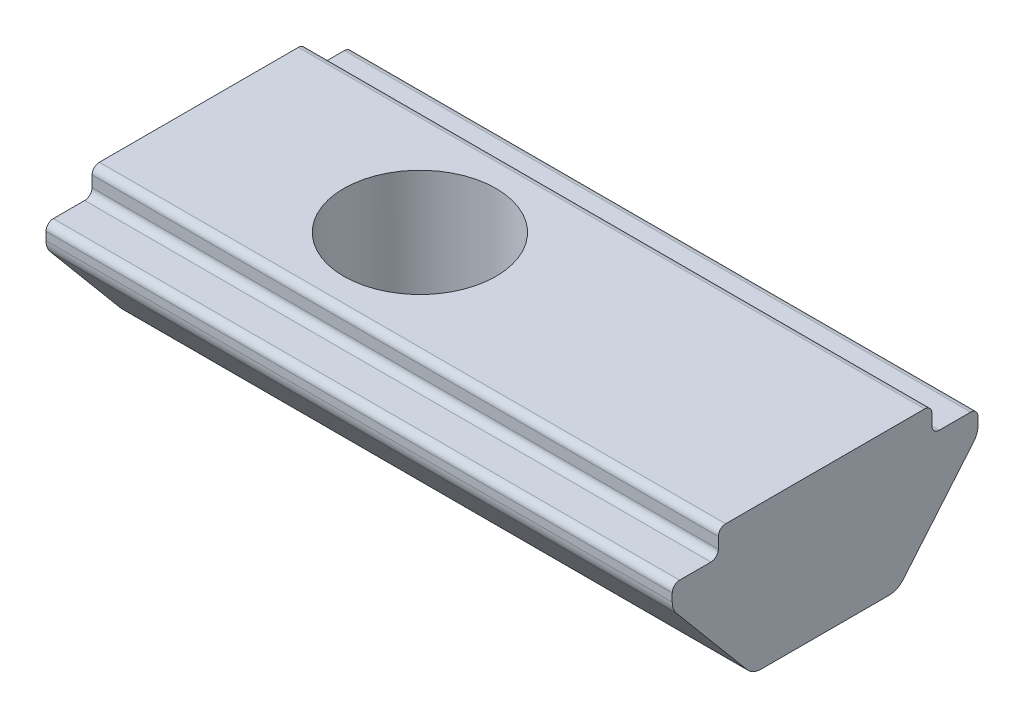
from build123d import *

# Parameters (mm, degrees)
BOSS_EXTRUDE1_DEPTH = 17
FILLET1_R           = 0.2
FILLET2_R           = 0.5
SKETCH2_W           = 1.75
SKETCH2_H           = 0.95
TAP1_D              = 4.134


with BuildPart() as part:
    # Sketch1 → Boss-Extrude1 (new body)
    with BuildSketch(Plane(origin=(-6, 0, 0), x_dir=(0, 0, -1), z_dir=(1, 0, 0))):
        Polygon((2.9, 0.7), (-2.9, 0.7), (-2.9, 0), (-4.15, 0), (-4.15, -0.6), (-1.968340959, -3.2), (1.968340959, -3.2), (4.15, -0.6), (4.15, 0), (2.9, 0), align=None)
    extrude(amount=BOSS_EXTRUDE1_DEPTH)

    # Fillet1
    fillet1_edges = [part.edges().sort_by_distance(p)[0] for p in [
        (2.5, 0, 4.15),
        (2.5, 0, 2.9),
        (2.5, 0.7, 2.9),
        (2.5, 0.7, -2.9),
        (2.5, 0, -2.9),
        (2.5, 0, -4.15),
    ]]
    fillet(fillet1_edges, radius=FILLET1_R)

    # Fillet2
    fillet2_edges = [part.edges().sort_by_distance(p)[0] for p in [
        (2.5, -0.6, -4.15),
        (2.5, -3.2, -1.968340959),
        (2.5, -3.2, 1.968340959),
        (2.5, -0.6, 4.15),
    ]]
    fillet(fillet2_edges, radius=FILLET2_R)

    # Sketch2 → Cut-Revolve1 (revolve, cut)
    with BuildSketch(Plane(origin=(6.5, 0, 0), x_dir=(0, 0, -1), z_dir=(1, 0, 0)), mode=Mode.PRIVATE) as cut_revolve1_sk:
        with Locations((0.875, -2.725)):
            Rectangle(SKETCH2_W, SKETCH2_H)
    revolve(cut_revolve1_sk.sketch.rotate(Axis((6.5, 0, 0), (0, -1, 0)), 180), axis=Axis((6.5, 0, 0), (0, -1, 0)), mode=Mode.SUBTRACT)

    # Sketch3 → Revolve1 (revolve)
    with BuildSketch(Plane(origin=(6.5, 0, 0), x_dir=(0, 0, -1), z_dir=(1, 0, 0))):
        with BuildLine():
            Line((-1.75, -2.25), (0, -2.25))
            Line((0, -2.25), (0, -4))
            ThreePointArc((0, -4), (-1.237436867, -3.487436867), (-1.75, -2.25))
        make_face()
    revolve(axis=Axis((6.5, 0, 0), (0, -1, 0)))

    # Tap1 (through all)
    with Locations(Plane(origin=(0, 0.7, 0), x_dir=(1, 0, 0), z_dir=(0, 1, 0))):
        with Locations((0, 0)):
            Hole(TAP1_D / 2)


solid = part.part
